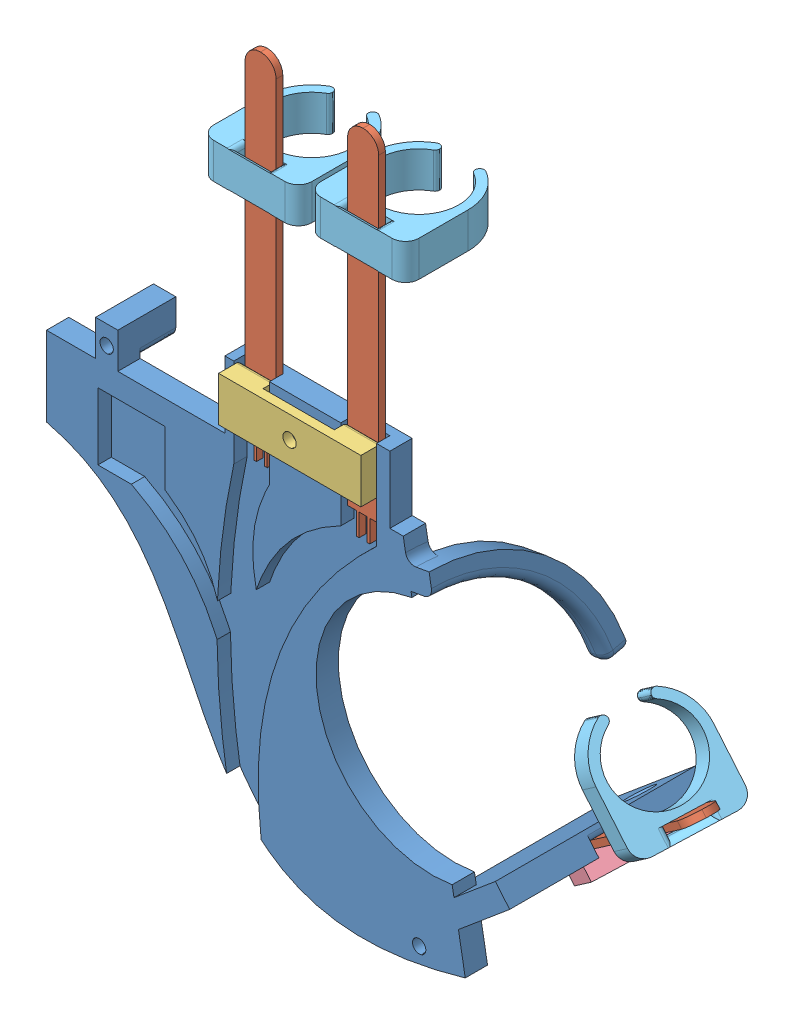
SolidWorks assembly système digi controle-main.SLDASM, configuration Défaut (file format 10000). Lengths in mm.
Overall size (143.38 165.79 48.5).
9 component instances, 5 part files, 16 mates.
Components (placement in the parent):
- support main-1: support main.SLDPRT [Défaut] at (-56.1467 33.7263 121.7658) size (103.87 104.27 45)
- capteur flexion-1: capteur flexion.SLDPRT [Défaut] at (16.8533 106.9567 123.7658) x (0 -1 0) z (0 0 1) size (80 7 1.5)
- capteur flexion-2: capteur flexion.SLDPRT [Défaut] at (-6.1467 110.2531 123.7658) x (0 -1 0) z (0 0 1) size (80 7 1.5)
- capteur flexion-3: capteur flexion.SLDPRT [Défaut] at (86.2693 9.423 117.9965) x (-0.719846 -0.604023 -0.34202) z (0.642788 -0.766044 0) size (80 7 1.5)
- fixe capteur index majeur-1: fixe capteur index majeur.SLDPRT [Défaut] at (-14.0467 48.1453 125.2658) x (1 0 0) z (0 -1 0) size (31.9 5 10)
- fixe capteur pouce-1: fixe capteur pouce.SLDPRT [Défaut] at (40.1417 -31.2408 104.082) x (-0.719846 -0.604023 -0.34202) z (-0.262003 -0.219846 0.939693) size (10 5 20)
- support doigt-1: support doigt.SLDPRT [Défaut] at (13.8533 90.8223 113.2658) x (1 0 0) z (0 -1 0) size (22 23.66 8)
- support doigt-2: support doigt.SLDPRT [Défaut] at (-10.1467 89.8346 113.2658) x (1 0 0) z (0 -1 0) size (22 23.66 8)
- support doigt-3: support doigt.SLDPRT [Défaut] at (72.3776 11.4733 118.8596) x (0.262003 0.219846 -0.939693) z (-0.719846 -0.604023 -0.34202) size (22 23.66 8)
Mates (geometry in assembly coordinates):
- Coïncidente1: coincident anti-aligned: plane of support main-1 through (-3.976 -3.1402 123.7658) normal (0 0 1); plane of capteur flexion-1 through (16.8533 106.9567 123.7658) normal (0 0 -1)
- Coïncidente2: coincident aligned: line of support main-1 through (9.8533 48.7263 123.7658) axis (0 -1 0); line of capteur flexion-1 through (9.8533 103.4567 123.7658) axis (0 -1 0)
- Coïncidente3: coincident anti-aligned: plane of support main-1 through (-3.976 -3.1402 123.7658) normal (0 0 1); plane of capteur flexion-2 through (-6.1467 110.2531 123.7658) normal (0 0 -1)
- Coïncidente4: coincident aligned: line of support main-1 through (-6.1467 28.7263 123.7658) axis (0 1 0); line of capteur flexion-2 through (-6.1467 35.2531 123.7658) axis (0 1 0)
- Coïncidente5: coincident anti-aligned: plane of support main-1 through (14.6632 -50.6616 121.7658) normal (0.642788 -0.766044 0); plane of capteur flexion-3 through (86.2693 9.423 117.9965) normal (-0.642788 0.766044 0)
- Coïncidente6: coincident aligned: line of support main-1 through (26.6015 -40.6442 89.6466) axis (0.719846 0.604023 0.34202); line of capteur flexion-3 through (32.2808 -35.8787 92.345) axis (0.719846 0.604023 0.34202)
- Coïncidente7: coincident anti-aligned: plane of capteur flexion-1 through (16.8533 106.9567 125.2658) normal (0 0 1); plane of fixe capteur index majeur-1 through (9.9033 38.1453 125.2658) normal (0 0 -1)
- Coïncidente8: coincident anti-aligned: plane of support main-1 through (17.8533 48.7263 123.7658) normal (-1 0 0); plane of fixe capteur index majeur-1 through (17.8533 38.1453 125.2658) normal (1 0 0)
- Coïncidente9: coincident anti-aligned: plane of capteur flexion-3 through (87.2335 8.2739 117.9965) normal (0.642788 -0.766044 0); plane of fixe capteur pouce-1 through (35.0262 -35.5332 93.1913) normal (-0.642788 0.766044 0)
- Coïncidente10: coincident anti-aligned: plane of support main-1 through (49.6515 -29.1355 98.7658) normal (-0.262003 -0.219846 0.939693); plane of fixe capteur pouce-1 through (36.9545 -37.8314 93.1913) normal (0.262003 0.219846 -0.939693)
- Coïncidente11: coincident anti-aligned: plane of capteur flexion-1 through (16.8533 106.9567 123.7658) normal (0 0 -1); plane of support doigt-1 through (9.8533 90.8223 123.7658) normal (0 0 1)
- Coïncidente12: coincident aligned: line of capteur flexion-1 through (9.8533 103.4567 123.7658) axis (0 -1 0); line of support doigt-1 through (9.8533 89.8223 123.7658) axis (0 -1 0)
- Coïncidente13: coincident anti-aligned: plane of capteur flexion-2 through (-6.1467 110.2531 123.7658) normal (0 0 -1); plane of support doigt-2 through (-14.1467 89.8346 123.7658) normal (0 0 1)
- Coïncidente15: coincident anti-aligned: plane of capteur flexion-3 through (86.2693 9.423 117.9965) normal (-0.642788 0.766044 0); plane of support doigt-3 through (78.0789 2.5504 122.6184) normal (0.642788 -0.766044 0)
- Coïncidente19: coincident anti-aligned: line of capteur flexion-3 through (32.2808 -35.8787 92.345) axis (0.719846 0.604023 0.34202); line of support doigt-3 through (79.4551 3.7052 114.7588) axis (-0.719846 -0.604023 -0.34202)
- Coïncidente20: coincident anti-aligned: line of capteur flexion-2 through (-6.1467 35.2531 123.7658) axis (0 1 0); line of support doigt-2 through (-6.1467 88.8346 123.7658) axis (0 -1 0)
